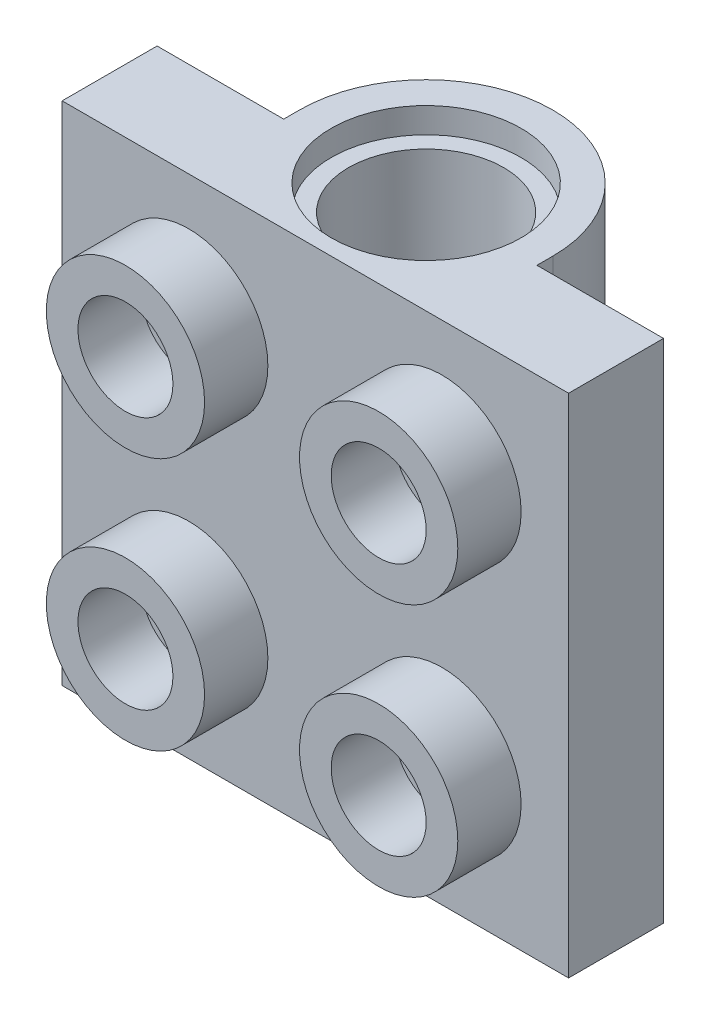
from build123d import *

# Parameters (mm, degrees)
SKETCH_1_W                  = 16
SKETCH_1_H                  = 16
EXTRUDE_334_DEPTH           = 3
SKETCH_2_R                  = 2.5
EXTRUDE_1_DEPTH             = 2
PATTERN_LINEAR_1_COUNT      = 2
PATTERN_LINEAR_1_PITCH      = 8
PATTERN_LINEAR_1_COUNT_DIR2 = 2
PATTERN_LINEAR_1_PITCH_DIR2 = 8
SKETCH_3_W                  = 13
SKETCH_3_H                  = 13
CUT_EXTRUDE_1_DEPTH         = 2
EXTRUDE_START               = -16
EXTRUDE_2_DEPTH             = 16
CUT_EXTRUDE_START           = -16
SKETCH_5_R                  = 2.45
CUT_EXTRUDE_2_DEPTH         = 16
SKETCH_6_R                  = 3
CUT_EXTRUDE_3_DEPTH         = 0.8
CUT_EXTRUDE_START_2         = -0.8
SKETCH_7_R                  = 3
CUT_EXTRUDE_4_DEPTH         = 0.8
SKETCH_8_W                  = 10.750978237
SKETCH_8_H                  = 2
CUT_EXTRUDE_5_DEPTH         = 7
SKETCH_9_R                  = 1.5
CUT_EXTRUDE_6_DEPTH         = 2
PATTERN_LINEAR_2_COUNT      = 2
PATTERN_LINEAR_2_PITCH      = 8
PATTERN_LINEAR_2_COUNT_DIR2 = 2
PATTERN_LINEAR_2_PITCH_DIR2 = 8


with BuildPart() as part:
    # Sketch 1 → Extrude 334 (new body)
    with BuildSketch(Plane(origin=(0.007312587, -0.1312965, 0), x_dir=(1, 0, 0), z_dir=(0, 0, 1))):
        with Locations((-0.584916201, -0.000418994)):
            Rectangle(SKETCH_1_W, SKETCH_1_H)
    extrude(amount=-EXTRUDE_334_DEPTH)

    # Sketch 2 → Extrude 1 (add)
    with BuildSketch(Plane.XY):
        with Locations((-4.577603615, -4.131715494)):
            Circle(SKETCH_2_R)
    extrude_1 = extrude(amount=EXTRUDE_1_DEPTH)

    # Pattern Linear 1: Extrude 1 2 × 2
    with Locations(*[(i * PATTERN_LINEAR_1_PITCH, j * PATTERN_LINEAR_1_PITCH_DIR2, 0) for i in range(PATTERN_LINEAR_1_COUNT) for j in range(PATTERN_LINEAR_1_COUNT_DIR2) if (i, j) != (0, 0)]):
        add(extrude_1)

    # Sketch 3 → Cut-Extrude 1 (cut)
    with BuildSketch(Plane(origin=(0, 0, -3), x_dir=(-1, 0, 0), z_dir=(0, 0, -1))):
        with Locations((0.577603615, -0.131715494)):
            Rectangle(SKETCH_3_W, SKETCH_3_H)
    extrude(amount=-CUT_EXTRUDE_1_DEPTH, mode=Mode.SUBTRACT)

    # Sketch 4 → Extrude 2 (add)
    with BuildSketch(Plane.XZ.offset(8.131715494).offset(EXTRUDE_START)):
        with BuildLine():
            Line((3.422396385, -3.5), (3.422396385, 0))
            Line((3.422396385, 0), (-4.577603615, 0))
            Line((-4.577603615, 0), (-4.577603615, -3.5))
            ThreePointArc((-4.577603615, -3.5), (-0.577603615, -7.5), (3.422396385, -3.5))
        make_face()
    extrude(amount=EXTRUDE_2_DEPTH)

    # Sketch 5 → Cut-Extrude 2 (cut)
    with BuildSketch(Plane.XZ.offset(8.131715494).offset(CUT_EXTRUDE_START)):
        with Locations(Location((-0.577603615, -3.5, 0), (0, 0, 270))):
            Circle(SKETCH_5_R)
    extrude(amount=CUT_EXTRUDE_2_DEPTH, mode=Mode.SUBTRACT)

    # Sketch 6 → Cut-Extrude 3 (cut)
    with BuildSketch(Plane.XZ.offset(8.131715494)):
        with Locations(Location((-0.577603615, -3.5, 0), (0, 0, 270))):
            Circle(SKETCH_6_R)
    extrude(amount=-CUT_EXTRUDE_3_DEPTH, mode=Mode.SUBTRACT)

    # Sketch 7 → Cut-Extrude 4 (cut)
    with BuildSketch(Plane(origin=(1.83824109, 7.868284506, 1.211578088), x_dir=(-1, 0, 0), z_dir=(0, 1, 0)).offset(CUT_EXTRUDE_START_2)):
        with Locations(Location((2.415844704, -4.711578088, 0), (0, 0, 270))):
            Circle(SKETCH_7_R)
    extrude(amount=CUT_EXTRUDE_4_DEPTH, mode=Mode.SUBTRACT)

    # Sketch 8 → Cut-Extrude 5 (cut)
    with BuildSketch(Plane(origin=(0, 0, -1), x_dir=(-1, 0, 0), z_dir=(0, 0, -1))):
        with Locations((0.445649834, -0.131715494)):
            Rectangle(SKETCH_8_W, SKETCH_8_H)
    extrude(amount=CUT_EXTRUDE_5_DEPTH, mode=Mode.SUBTRACT)

    # Sketch 9 → Cut-Extrude 6 (cut)
    with BuildSketch(Plane.XY.offset(2)):
        with Locations((-4.577603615, -4.131715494)):
            Circle(SKETCH_9_R)
    cut_extrude_6 = extrude(amount=-CUT_EXTRUDE_6_DEPTH, mode=Mode.SUBTRACT)

    # Pattern Linear 2: Cut-Extrude 6 2 × 2
    with Locations(*[(j * PATTERN_LINEAR_2_PITCH_DIR2, i * PATTERN_LINEAR_2_PITCH, 0) for i in range(PATTERN_LINEAR_2_COUNT) for j in range(PATTERN_LINEAR_2_COUNT_DIR2) if (i, j) != (0, 0)]):
        add(cut_extrude_6, mode=Mode.SUBTRACT)


solid = part.part
